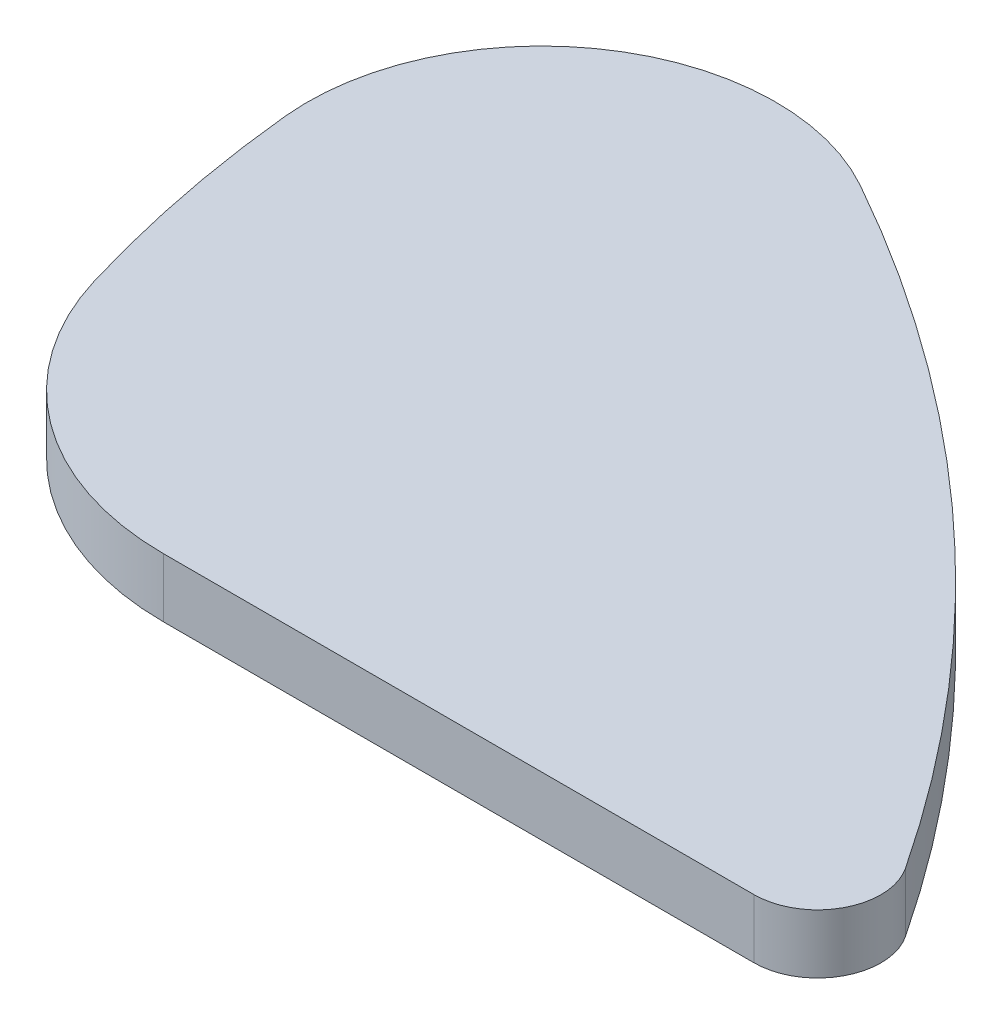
from build123d import *

# Parameters (mm, degrees)
EXTRUDE1_DEPTH = 10


with BuildPart() as part:
    # Sketch1 → Extrude1 (new body)
    with BuildSketch(Plane(origin=(0, 0, 0), x_dir=(1, 0, 0), z_dir=(0, 1, 0))):
        with BuildLine():
            Line((0, 0), (100, 0))
            ThreePointArc((100, 0), (109.455614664, 5.651897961), (108.955128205, 16.656538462))
            ThreePointArc((108.955128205, 16.656538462), (79.990192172, 53.732714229), (45.552820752, 85.790128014))
            ThreePointArc((45.552820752, 85.790128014), (25.792057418, 100.215610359), (4.940478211, 113.013811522))
            ThreePointArc((4.940478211, 113.013811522), (-36.152767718, 111.578532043), (-53.859007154, 74.467833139))
            ThreePointArc((-53.859007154, 74.467833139), (-50.814925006, 54.07667073), (-45.829799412, 34.071309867))
            ThreePointArc((-45.829799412, 34.071309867), (-28.553566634, 9.451004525), (0, 0))
        make_face()
    extrude(amount=EXTRUDE1_DEPTH)


solid = part.part
